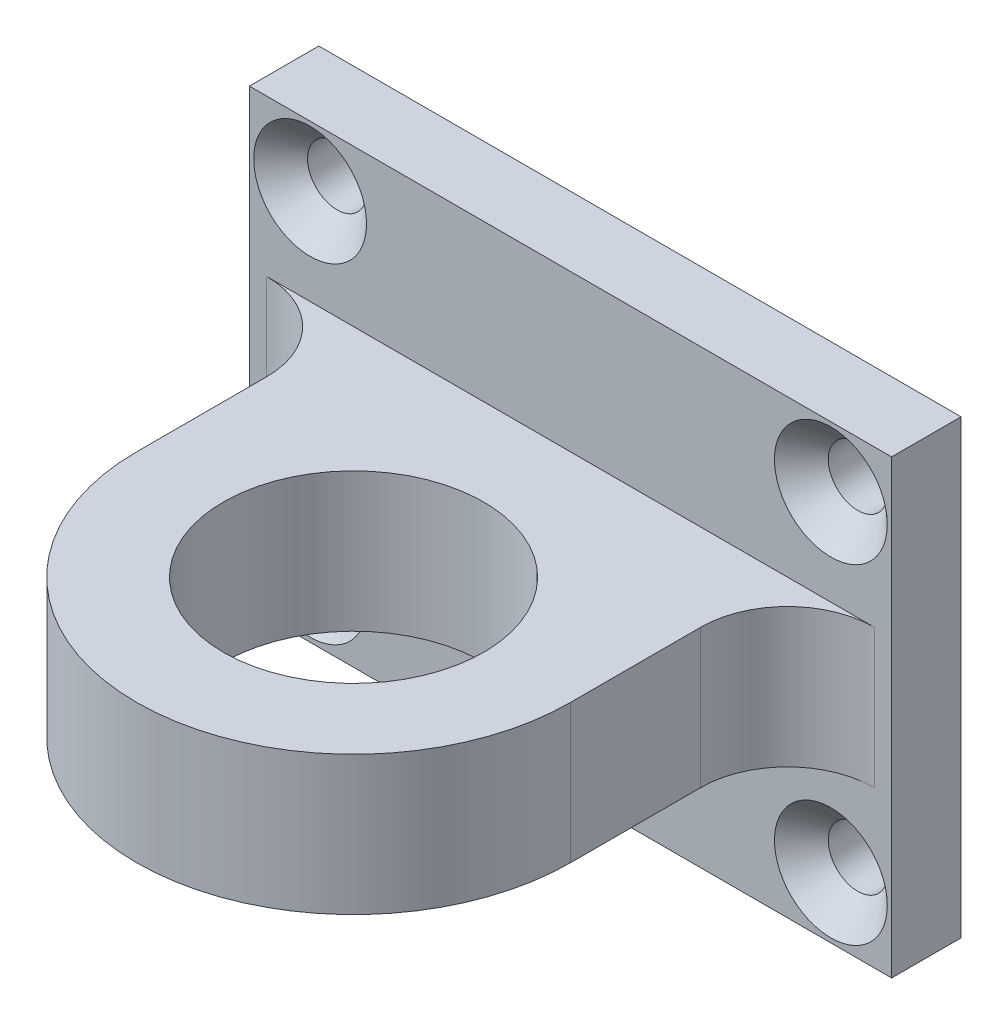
from build123d import *

# Parameters (mm, degrees)
SKETCH_1_W                  = 37
SKETCH_1_H                  = 26
EXTRUDE_1_DEPTH             = 4
SKETCH_2_R                  = 7.5
EXTRUDE_2_DEPTH             = 4
HOLE_WIZARD_M31_D           = 3.4
HOLE_WIZARD_M31_CSINK_D     = 6.5
HOLE_WIZARD_M31_CSINK_ANGLE = 90
FILLET_1_R                  = 5


with BuildPart() as part:
    # Sketch 1 → Extrude 1 (new body)
    with BuildSketch(Plane.XY):
        Rectangle(SKETCH_1_W, SKETCH_1_H)
    extrude(amount=EXTRUDE_1_DEPTH)

    # Sketch 2 → Extrude 2 (add, symmetric)
    with BuildSketch(Plane(origin=(0, 0, 0), x_dir=(1, 0, 0), z_dir=(0, 1, 0))):
        with BuildLine():
            Line((12.5, -4), (-12.5, -4))
            Line((-12.5, -4), (-12.5, -16.5))
            ThreePointArc((-12.5, -16.5), (0, -29), (12.5, -16.5))
            Line((12.5, -16.5), (12.5, -4))
        make_face()
        with Locations(Location((0, -16.5, 0), (0, 0, 270))):
            Circle(SKETCH_2_R, mode=Mode.SUBTRACT)
    extrude(amount=EXTRUDE_2_DEPTH, both=True)

    # Hole Wizard M31 (through all)
    with Locations(Plane.XY.offset(4)):
        with Locations((-15, -9.5), (15, -9.5), (-15, 9.5), (15, 9.5)):
            CounterSinkHole(HOLE_WIZARD_M31_D / 2, HOLE_WIZARD_M31_CSINK_D / 2, counter_sink_angle=HOLE_WIZARD_M31_CSINK_ANGLE)

    # Fillet 1
    fillet_1_edges = [part.edges().sort_by_distance(p)[0] for p in [
        (-12.5, 0, 4),
        (12.5, 0, 4),
    ]]
    fillet(fillet_1_edges, radius=FILLET_1_R)


solid = part.part
